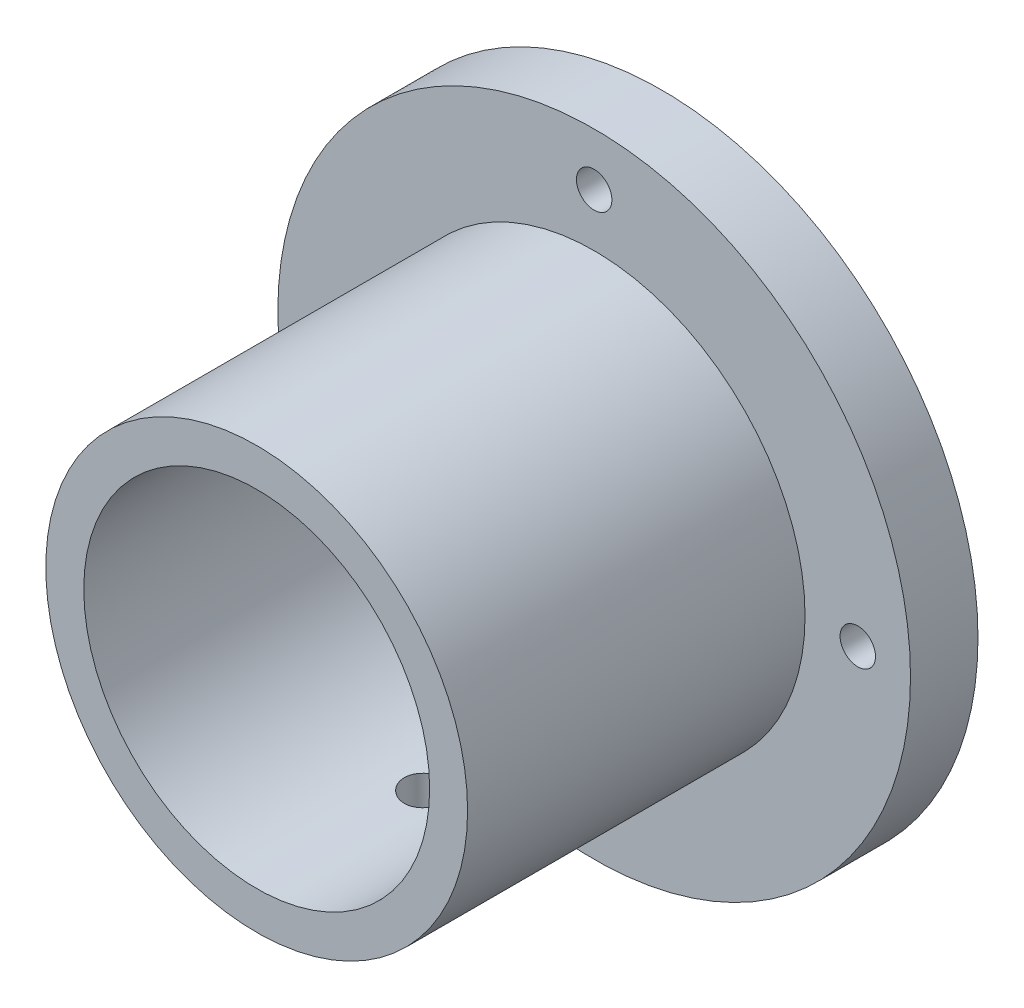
from build123d import *

# Parameters (mm, degrees)
SKETCH_1_R          = 37.5
SKETCH_1_R_2        = 2.1
EXTRUDE_1_DEPTH     = 8
SKETCH_2_R          = 25
EXTRUDE_2_DEPTH     = 40
SKETCH_3_R          = 20.5
CUT_EXTRUDE_1_DEPTH = 72.529714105
SKETCH_4_R          = 2.5
CUT_EXTRUDE_2_DEPTH = 40


with BuildPart() as part:
    # Sketch 1 → Extrude 1 (new body)
    with BuildSketch(Plane.XY):
        Circle(SKETCH_1_R)
        with Locations((0, 31.25)):
            Circle(SKETCH_1_R_2, mode=Mode.SUBTRACT)
        with Locations((-31.25, 0)):
            Circle(SKETCH_1_R_2, mode=Mode.SUBTRACT)
        with Locations((0, -31.25)):
            Circle(SKETCH_1_R_2, mode=Mode.SUBTRACT)
        with Locations((31.25, 0)):
            Circle(SKETCH_1_R_2, mode=Mode.SUBTRACT)
    extrude(amount=EXTRUDE_1_DEPTH)

    # Sketch 2 → Extrude 2 (add)
    with BuildSketch(Plane.XY.offset(8)):
        Circle(SKETCH_2_R)
    extrude(amount=EXTRUDE_2_DEPTH)

    # Sketch 3 → Cut-Extrude 1 (cut, through all)
    with BuildSketch(Plane.XY.offset(48)):
        Circle(SKETCH_3_R)
    extrude(amount=-CUT_EXTRUDE_1_DEPTH, mode=Mode.SUBTRACT)

    # Sketch 4 → Cut-Extrude 2 (cut)
    with BuildSketch(Plane(origin=(0, 10, 0), x_dir=(-1, 0, 0), z_dir=(0, 1, 0))):
        with Locations(Location((0, 28, 0), (0, 0, 90))):
            Circle(SKETCH_4_R)
    extrude(amount=-CUT_EXTRUDE_2_DEPTH, mode=Mode.SUBTRACT)


solid = part.part
